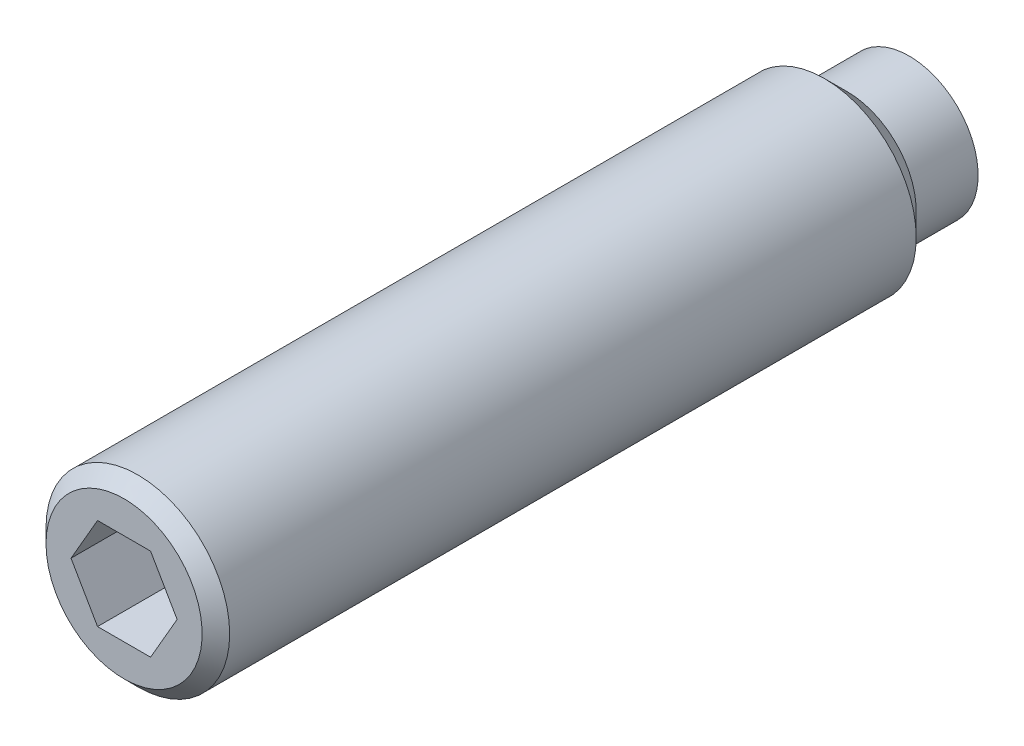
ISO-10303-21;
HEADER;
FILE_DESCRIPTION(('STEP AP214'),'2;1');
FILE_NAME('part.step','',(''),(''),'','','');
FILE_SCHEMA(('AUTOMOTIVE_DESIGN { 1 0 10303 214 1 1 1 1 }'));
ENDSEC;
DATA;
#1=APPLICATION_CONTEXT('core data for automotive mechanical design processes');
#2=APPLICATION_PROTOCOL_DEFINITION('international standard','automotive_design',2000,#1);
#3=PRODUCT_CONTEXT('',#1,'mechanical');
#4=PRODUCT('Part','Part','',(#3));
#5=PRODUCT_RELATED_PRODUCT_CATEGORY('part','',(#4));
#6=PRODUCT_DEFINITION_FORMATION('','',#4);
#7=PRODUCT_DEFINITION_CONTEXT('part definition',#1,'design');
#8=PRODUCT_DEFINITION('design','',#6,#7);
#9=PRODUCT_DEFINITION_SHAPE('','',#8);
#10=(LENGTH_UNIT() NAMED_UNIT(*) SI_UNIT(.MILLI.,.METRE.));
#11=(NAMED_UNIT(*) PLANE_ANGLE_UNIT() SI_UNIT($,.RADIAN.));
#12=(NAMED_UNIT(*) SI_UNIT($,.STERADIAN.) SOLID_ANGLE_UNIT());
#13=UNCERTAINTY_MEASURE_WITH_UNIT(LENGTH_MEASURE(1.E-05),#10,'distance_accuracy_value','');
#14=(GEOMETRIC_REPRESENTATION_CONTEXT(3) GLOBAL_UNCERTAINTY_ASSIGNED_CONTEXT((#13)) GLOBAL_UNIT_ASSIGNED_CONTEXT((#10,
#11,#12)) REPRESENTATION_CONTEXT('',''));
#15=CARTESIAN_POINT('',(0.,0.,0.));
#16=DIRECTION('',(0.,0.,1.));
#17=DIRECTION('',(1.,0.,0.));
#18=AXIS2_PLACEMENT_3D('',#15,#16,#17);
#19=CARTESIAN_POINT('',(0.,0.,-9.98399584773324));
#20=DIRECTION('',(0.,0.,1.));
#21=DIRECTION('',(1.,0.,0.));
#22=AXIS2_PLACEMENT_3D('',#19,#20,#21);
#23=CONICAL_SURFACE('',#22,4.64771999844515,1.04719754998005);
#24=CARTESIAN_POINT('',(4.62000000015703,1.07989878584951E-09,-9.9999999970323));
#25=CARTESIAN_POINT('',(4.51848948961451,0.17582136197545,-10.0586241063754));
#26=CARTESIAN_POINT('',(4.41610274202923,0.35316041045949,-10.1119396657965));
#27=CARTESIAN_POINT('',(4.20955648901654,0.710909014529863,-10.2050003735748));
#28=CARTESIAN_POINT('',(4.10539331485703,0.891324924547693,-10.2447126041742));
#29=CARTESIAN_POINT('',(3.89835780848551,1.24992094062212,-10.3065275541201));
#30=CARTESIAN_POINT('',(3.7955173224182,1.42804588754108,-10.3290417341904));
#31=CARTESIAN_POINT('',(3.58935270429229,1.78513348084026,-10.3559139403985));
#32=CARTESIAN_POINT('',(3.48602932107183,1.96409483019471,-10.3602942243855));
#33=CARTESIAN_POINT('',(3.29298066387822,2.2984649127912,-10.3511584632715));
#34=CARTESIAN_POINT('',(3.20322642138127,2.45392382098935,-10.3398855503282));
#35=CARTESIAN_POINT('',(3.02430265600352,2.7638288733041,-10.3041642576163));
#36=CARTESIAN_POINT('',(2.93513375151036,2.91827394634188,-10.2797036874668));
#37=CARTESIAN_POINT('',(2.75584138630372,3.22881743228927,-10.2185569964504));
#38=CARTESIAN_POINT('',(2.66574060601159,3.38487656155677,-10.1816117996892));
#39=CARTESIAN_POINT('',(2.48688250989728,3.69466787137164,-10.0977618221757));
#40=CARTESIAN_POINT('',(2.39812290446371,3.84840401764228,-10.050876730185));
#41=CARTESIAN_POINT('',(2.31000000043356,4.00103736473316,-9.99999999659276));
#42=B_SPLINE_CURVE_WITH_KNOTS('',3,(#24,#25,#26,#27,#28,#29,#30,#31,#32,#33,#34,#35,#36,#37,#38,
#39,#40,#41),.UNSPECIFIED.,.F.,.F.,(4,2,2,2,2,2,2,2,4),(0.,0.634196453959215,1.26991689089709,
1.88990521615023,2.509132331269,3.04820588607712,3.58777860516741,4.13931646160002,
4.68977188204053),.UNSPECIFIED.);
#43=CARTESIAN_POINT('',(4.61999999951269,0.,-9.9999999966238));
#44=VERTEX_POINT('',#43);
#45=CARTESIAN_POINT('',(2.30999999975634,4.00103736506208,-9.9999999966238));
#46=VERTEX_POINT('',#45);
#47=EDGE_CURVE('E144',#44,#46,#42,.T.);
#48=ORIENTED_EDGE('',*,*,#47,.T.);
#49=CARTESIAN_POINT('',(2.3099999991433,4.00103736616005,-9.9999999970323));
#50=CARTESIAN_POINT('',(2.1203719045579,4.0010373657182,-10.0547466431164));
#51=CARTESIAN_POINT('',(1.92924368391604,4.00103736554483,-10.1048687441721));
#52=CARTESIAN_POINT('',(1.54388249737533,4.00103736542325,-10.1934533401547));
#53=CARTESIAN_POINT('',(1.34964358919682,4.00103736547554,-10.2318897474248));
#54=CARTESIAN_POINT('',(0.963345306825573,4.00103736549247,-10.2937001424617));
#55=CARTESIAN_POINT('',(0.771340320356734,4.00103736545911,-10.3174036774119));
#56=CARTESIAN_POINT('',(0.386222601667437,4.00103736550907,-10.3492242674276));
#57=CARTESIAN_POINT('',(0.193111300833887,4.00103736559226,-10.3573582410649));
#58=CARTESIAN_POINT('',(-0.193111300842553,4.00103736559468,-10.3573582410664));
#59=CARTESIAN_POINT('',(-0.386222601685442,4.00103736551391,-10.3492242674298));
#60=CARTESIAN_POINT('',(-0.77134032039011,4.00103736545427,-10.3174036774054));
#61=CARTESIAN_POINT('',(-0.96334530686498,4.0010373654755,-10.2937001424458));
#62=CARTESIAN_POINT('',(-1.34964358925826,4.00103736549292,-10.2318897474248));
#63=CARTESIAN_POINT('',(-1.54388249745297,4.00103736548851,-10.1934533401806));
#64=CARTESIAN_POINT('',(-1.92924368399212,4.00103736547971,-10.1048687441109));
#65=CARTESIAN_POINT('',(-2.12037190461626,4.00103736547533,-10.0547466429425));
#66=CARTESIAN_POINT('',(-2.3099999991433,4.00103736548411,-9.99999999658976));
#67=B_SPLINE_CURVE_WITH_KNOTS('',3,(#49,#50,#51,#52,#53,#54,#55,#56,#57,#58,#59,#60,#61,#62,#63,
#64,#65,#66),.UNSPECIFIED.,.F.,.F.,(4,2,2,2,2,2,2,2,4),(0.,0.592300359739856,1.18591344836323,
1.76571952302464,2.34489519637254,2.92407086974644,3.50387694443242,4.09749003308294,
4.68979039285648),.UNSPECIFIED.);
#68=CARTESIAN_POINT('',(-2.30999999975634,4.00103736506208,-9.9999999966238));
#69=VERTEX_POINT('',#68);
#70=EDGE_CURVE('E165',#46,#69,#67,.T.);
#71=ORIENTED_EDGE('',*,*,#70,.T.);
#72=CARTESIAN_POINT('',(-2.31000000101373,4.00103736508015,-9.9999999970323));
#73=CARTESIAN_POINT('',(-2.41151051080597,3.82521600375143,-10.0586241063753));
#74=CARTESIAN_POINT('',(-2.51389725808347,3.64787695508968,-10.1119396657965));
#75=CARTESIAN_POINT('',(-2.72044351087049,3.29012835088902,-10.2050003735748));
#76=CARTESIAN_POINT('',(-2.82460668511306,3.10971244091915,-10.2447126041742));
#77=CARTESIAN_POINT('',(-3.03164219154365,2.75111642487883,-10.3065275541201));
#78=CARTESIAN_POINT('',(-3.13448267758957,2.57299147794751,-10.3290417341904));
#79=CARTESIAN_POINT('',(-3.34064729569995,2.21590388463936,-10.3559139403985));
#80=CARTESIAN_POINT('',(-3.44397067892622,2.03694253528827,-10.3602942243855));
#81=CARTESIAN_POINT('',(-3.63701933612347,1.70257245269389,-10.3511584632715));
#82=CARTESIAN_POINT('',(-3.72677357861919,1.54711354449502,-10.3398855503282));
#83=CARTESIAN_POINT('',(-3.90569734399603,1.23720849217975,-10.3041642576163));
#84=CARTESIAN_POINT('',(-3.99486624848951,1.08276341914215,-10.2797036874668));
#85=CARTESIAN_POINT('',(-4.17415861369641,0.772219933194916,-10.2185569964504));
#86=CARTESIAN_POINT('',(-4.26425939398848,0.61616080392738,-10.1816117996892));
#87=CARTESIAN_POINT('',(-4.44311749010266,0.306369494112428,-10.0977618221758));
#88=CARTESIAN_POINT('',(-4.53187709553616,0.152633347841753,-10.050876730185));
#89=CARTESIAN_POINT('',(-4.61999999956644,7.50947213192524E-10,-9.99999999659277));
#90=B_SPLINE_CURVE_WITH_KNOTS('',3,(#72,#73,#74,#75,#76,#77,#78,#79,#80,#81,#82,#83,#84,#85,#86,
#87,#88,#89),.UNSPECIFIED.,.F.,.F.,(4,2,2,2,2,2,2,2,4),(0.,0.634196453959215,1.26991689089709,
1.88990521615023,2.509132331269,3.04820588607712,3.58777860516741,4.13931646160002,
4.68977188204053),.UNSPECIFIED.);
#91=CARTESIAN_POINT('',(-4.61999999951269,0.,-9.9999999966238));
#92=VERTEX_POINT('',#91);
#93=EDGE_CURVE('E172',#69,#92,#90,.T.);
#94=ORIENTED_EDGE('',*,*,#93,.T.);
#95=CARTESIAN_POINT('',(-4.62000000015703,-1.07989712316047E-09,-9.9999999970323));
#96=CARTESIAN_POINT('',(-4.51848948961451,-0.175821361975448,-10.0586241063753));
#97=CARTESIAN_POINT('',(-4.41610274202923,-0.353160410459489,-10.1119396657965));
#98=CARTESIAN_POINT('',(-4.20955648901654,-0.710909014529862,-10.2050003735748));
#99=CARTESIAN_POINT('',(-4.10539331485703,-0.891324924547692,-10.2447126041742));
#100=CARTESIAN_POINT('',(-3.89835780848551,-1.24992094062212,-10.3065275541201));
#101=CARTESIAN_POINT('',(-3.7955173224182,-1.42804588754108,-10.3290417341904));
#102=CARTESIAN_POINT('',(-3.58935270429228,-1.78513348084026,-10.3559139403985));
#103=CARTESIAN_POINT('',(-3.48602932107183,-1.96409483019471,-10.3602942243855));
#104=CARTESIAN_POINT('',(-3.29298066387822,-2.2984649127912,-10.3511584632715));
#105=CARTESIAN_POINT('',(-3.20322642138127,-2.45392382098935,-10.3398855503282));
#106=CARTESIAN_POINT('',(-3.02430265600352,-2.76382887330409,-10.3041642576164));
#107=CARTESIAN_POINT('',(-2.93513375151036,-2.91827394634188,-10.2797036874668));
#108=CARTESIAN_POINT('',(-2.75584138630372,-3.22881743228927,-10.2185569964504));
#109=CARTESIAN_POINT('',(-2.66574060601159,-3.38487656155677,-10.1816117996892));
#110=CARTESIAN_POINT('',(-2.48688250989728,-3.69466787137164,-10.0977618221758));
#111=CARTESIAN_POINT('',(-2.39812290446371,-3.84840401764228,-10.050876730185));
#112=CARTESIAN_POINT('',(-2.31000000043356,-4.00103736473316,-9.99999999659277));
#113=B_SPLINE_CURVE_WITH_KNOTS('',3,(#95,#96,#97,#98,#99,#100,#101,#102,#103,#104,#105,#106,
#107,#108,#109,#110,#111,#112),.UNSPECIFIED.,.F.,.F.,(4,2,2,2,2,2,2,2,4),(0.,0.634196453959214,
1.26991689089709,1.88990521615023,2.509132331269,3.04820588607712,3.58777860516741,
4.13931646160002,4.68977188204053),.UNSPECIFIED.);
#114=CARTESIAN_POINT('',(-2.30999999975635,-4.00103736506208,-9.9999999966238));
#115=VERTEX_POINT('',#114);
#116=EDGE_CURVE('E177',#92,#115,#113,.T.);
#117=ORIENTED_EDGE('',*,*,#116,.T.);
#118=CARTESIAN_POINT('',(-2.3099999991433,-4.00103736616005,-9.9999999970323));
#119=CARTESIAN_POINT('',(-2.1203719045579,-4.00103736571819,-10.0547466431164));
#120=CARTESIAN_POINT('',(-1.92924368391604,-4.00103736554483,-10.1048687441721));
#121=CARTESIAN_POINT('',(-1.54388249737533,-4.00103736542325,-10.1934533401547));
#122=CARTESIAN_POINT('',(-1.34964358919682,-4.00103736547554,-10.2318897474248));
#123=CARTESIAN_POINT('',(-0.963345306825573,-4.00103736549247,-10.2937001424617));
#124=CARTESIAN_POINT('',(-0.771340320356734,-4.00103736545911,-10.3174036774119));
#125=CARTESIAN_POINT('',(-0.386222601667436,-4.00103736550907,-10.3492242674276));
#126=CARTESIAN_POINT('',(-0.193111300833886,-4.00103736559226,-10.3573582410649));
#127=CARTESIAN_POINT('',(0.193111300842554,-4.00103736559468,-10.3573582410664));
#128=CARTESIAN_POINT('',(0.386222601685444,-4.00103736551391,-10.3492242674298));
#129=CARTESIAN_POINT('',(0.771340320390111,-4.00103736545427,-10.3174036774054));
#130=CARTESIAN_POINT('',(0.963345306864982,-4.0010373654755,-10.2937001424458));
#131=CARTESIAN_POINT('',(1.34964358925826,-4.00103736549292,-10.2318897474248));
#132=CARTESIAN_POINT('',(1.54388249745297,-4.00103736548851,-10.1934533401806));
#133=CARTESIAN_POINT('',(1.92924368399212,-4.00103736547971,-10.1048687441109));
#134=CARTESIAN_POINT('',(2.12037190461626,-4.00103736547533,-10.0547466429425));
#135=CARTESIAN_POINT('',(2.3099999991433,-4.00103736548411,-9.99999999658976));
#136=B_SPLINE_CURVE_WITH_KNOTS('',3,(#118,#119,#120,#121,#122,#123,#124,#125,#126,#127,#128,
#129,#130,#131,#132,#133,#134,#135),.UNSPECIFIED.,.F.,.F.,(4,2,2,2,2,2,2,2,4),(0.,
0.592300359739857,1.18591344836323,1.76571952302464,2.34489519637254,2.92407086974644,
3.50387694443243,4.09749003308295,4.68979039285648),.UNSPECIFIED.);
#137=CARTESIAN_POINT('',(2.30999999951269,-4.00103736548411,-9.99999999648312));
#138=VERTEX_POINT('',#137);
#139=EDGE_CURVE('E74',#115,#138,#136,.T.);
#140=ORIENTED_EDGE('',*,*,#139,.T.);
#141=CARTESIAN_POINT('',(2.31000000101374,-4.00103736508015,-9.9999999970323));
#142=CARTESIAN_POINT('',(2.41151051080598,-3.82521600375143,-10.0586241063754));
#143=CARTESIAN_POINT('',(2.51389725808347,-3.64787695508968,-10.1119396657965));
#144=CARTESIAN_POINT('',(2.72044351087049,-3.29012835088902,-10.2050003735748));
#145=CARTESIAN_POINT('',(2.82460668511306,-3.10971244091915,-10.2447126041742));
#146=CARTESIAN_POINT('',(3.03164219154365,-2.75111642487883,-10.3065275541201));
#147=CARTESIAN_POINT('',(3.13448267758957,-2.57299147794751,-10.3290417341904));
#148=CARTESIAN_POINT('',(3.34064729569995,-2.21590388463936,-10.3559139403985));
#149=CARTESIAN_POINT('',(3.44397067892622,-2.03694253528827,-10.3602942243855));
#150=CARTESIAN_POINT('',(3.63701933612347,-1.70257245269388,-10.3511584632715));
#151=CARTESIAN_POINT('',(3.72677357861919,-1.54711354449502,-10.3398855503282));
#152=CARTESIAN_POINT('',(3.90569734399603,-1.23720849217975,-10.3041642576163));
#153=CARTESIAN_POINT('',(3.99486624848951,-1.08276341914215,-10.2797036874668));
#154=CARTESIAN_POINT('',(4.17415861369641,-0.772219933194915,-10.2185569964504));
#155=CARTESIAN_POINT('',(4.26425939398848,-0.616160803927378,-10.1816117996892));
#156=CARTESIAN_POINT('',(4.44311749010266,-0.306369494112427,-10.0977618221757));
#157=CARTESIAN_POINT('',(4.53187709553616,-0.152633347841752,-10.050876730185));
#158=CARTESIAN_POINT('',(4.61999999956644,-7.50945622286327E-10,-9.99999999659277));
#159=B_SPLINE_CURVE_WITH_KNOTS('',3,(#141,#142,#143,#144,#145,#146,#147,#148,#149,#150,#151,
#152,#153,#154,#155,#156,#157,#158),.UNSPECIFIED.,.F.,.F.,(4,2,2,2,2,2,2,2,4),(0.,
0.634196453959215,1.26991689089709,1.88990521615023,2.509132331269,3.04820588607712,
3.58777860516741,4.13931646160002,4.68977188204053),.UNSPECIFIED.);
#160=EDGE_CURVE('E106',#138,#44,#159,.T.);
#161=ORIENTED_EDGE('',*,*,#160,.T.);
#162=EDGE_LOOP('',(#48,#71,#94,#117,#140,#161));
#163=FACE_BOUND('',#162,.T.);
#164=CARTESIAN_POINT('',(0.,0.,-12.6673582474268));
#165=VERTEX_POINT('',#164);
#166=VERTEX_LOOP('',#165);
#167=FACE_BOUND('',#166,.T.);
#168=ADVANCED_FACE('F16',(#163,#167),#23,.F.);
#169=CARTESIAN_POINT('',(-2.31,-4.00103736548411,0.));
#170=DIRECTION('',(0.,-1.,0.));
#171=DIRECTION('',(0.,0.,-1.));
#172=AXIS2_PLACEMENT_3D('',#169,#170,#171);
#173=PLANE('',#172);
#174=ORIENTED_EDGE('',*,*,#139,.F.);
#175=DIRECTION('',(0.,0.,1.));
#176=VECTOR('',#175,1.);
#177=CARTESIAN_POINT('',(-2.31,-4.0010373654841,0.));
#178=LINE('',#177,#176);
#179=CARTESIAN_POINT('',(-2.31,-4.00103736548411,0.));
#180=VERTEX_POINT('',#179);
#181=EDGE_CURVE('E95',#115,#180,#178,.T.);
#182=ORIENTED_EDGE('',*,*,#181,.T.);
#183=DIRECTION('',(1.,0.,0.));
#184=VECTOR('',#183,1.);
#185=CARTESIAN_POINT('',(0.,-4.00103736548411,0.));
#186=LINE('',#185,#184);
#187=CARTESIAN_POINT('',(2.31,-4.00103736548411,0.));
#188=VERTEX_POINT('',#187);
#189=EDGE_CURVE('E89',#188,#180,#186,.F.);
#190=ORIENTED_EDGE('',*,*,#189,.F.);
#191=DIRECTION('',(0.,0.,1.));
#192=VECTOR('',#191,1.);
#193=CARTESIAN_POINT('',(2.31,-4.00103736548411,0.));
#194=LINE('',#193,#192);
#195=EDGE_CURVE('E92',#188,#138,#194,.F.);
#196=ORIENTED_EDGE('',*,*,#195,.T.);
#197=EDGE_LOOP('',(#174,#182,#190,#196));
#198=FACE_BOUND('',#197,.T.);
#199=ADVANCED_FACE('F91',(#198),#173,.F.);
#200=CARTESIAN_POINT('',(-4.62,0.,0.));
#201=DIRECTION('',(-0.866025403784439,-0.5,0.));
#202=DIRECTION('',(0.5,-0.866025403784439,0.));
#203=AXIS2_PLACEMENT_3D('',#200,#201,#202);
#204=PLANE('',#203);
#205=DIRECTION('',(0.,0.,1.));
#206=VECTOR('',#205,1.);
#207=CARTESIAN_POINT('',(-4.62,0.,0.));
#208=LINE('',#207,#206);
#209=CARTESIAN_POINT('',(-4.62,0.,0.));
#210=VERTEX_POINT('',#209);
#211=EDGE_CURVE('E181',#92,#210,#208,.T.);
#212=ORIENTED_EDGE('',*,*,#211,.T.);
#213=DIRECTION('',(-0.5,0.866025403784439,0.));
#214=VECTOR('',#213,1.);
#215=CARTESIAN_POINT('',(-2.31,-4.00103736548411,0.));
#216=LINE('',#215,#214);
#217=EDGE_CURVE('E100',#180,#210,#216,.T.);
#218=ORIENTED_EDGE('',*,*,#217,.F.);
#219=ORIENTED_EDGE('',*,*,#181,.F.);
#220=ORIENTED_EDGE('',*,*,#116,.F.);
#221=EDGE_LOOP('',(#212,#218,#219,#220));
#222=FACE_BOUND('',#221,.T.);
#223=ADVANCED_FACE('F182',(#222),#204,.F.);
#224=CARTESIAN_POINT('',(-2.31,4.00103736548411,0.));
#225=DIRECTION('',(-0.866025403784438,0.5,0.));
#226=DIRECTION('',(-0.5,-0.866025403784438,0.));
#227=AXIS2_PLACEMENT_3D('',#224,#225,#226);
#228=PLANE('',#227);
#229=DIRECTION('',(0.,0.,1.));
#230=VECTOR('',#229,1.);
#231=CARTESIAN_POINT('',(-2.31,4.00103736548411,0.));
#232=LINE('',#231,#230);
#233=CARTESIAN_POINT('',(-2.31,4.00103736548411,0.));
#234=VERTEX_POINT('',#233);
#235=EDGE_CURVE('E248',#69,#234,#232,.T.);
#236=ORIENTED_EDGE('',*,*,#235,.T.);
#237=DIRECTION('',(0.5,0.866025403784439,0.));
#238=VECTOR('',#237,1.);
#239=CARTESIAN_POINT('',(-4.62,0.,0.));
#240=LINE('',#239,#238);
#241=EDGE_CURVE('E125',#210,#234,#240,.T.);
#242=ORIENTED_EDGE('',*,*,#241,.F.);
#243=ORIENTED_EDGE('',*,*,#211,.F.);
#244=ORIENTED_EDGE('',*,*,#93,.F.);
#245=EDGE_LOOP('',(#236,#242,#243,#244));
#246=FACE_BOUND('',#245,.T.);
#247=ADVANCED_FACE('F185',(#246),#228,.F.);
#248=CARTESIAN_POINT('',(2.31,4.00103736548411,0.));
#249=DIRECTION('',(0.,1.,0.));
#250=DIRECTION('',(0.,0.,1.));
#251=AXIS2_PLACEMENT_3D('',#248,#249,#250);
#252=PLANE('',#251);
#253=ORIENTED_EDGE('',*,*,#70,.F.);
#254=DIRECTION('',(0.,0.,1.));
#255=VECTOR('',#254,1.);
#256=CARTESIAN_POINT('',(2.31,4.00103736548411,0.));
#257=LINE('',#256,#255);
#258=CARTESIAN_POINT('',(2.31,4.00103736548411,0.));
#259=VERTEX_POINT('',#258);
#260=EDGE_CURVE('E244',#46,#259,#257,.T.);
#261=ORIENTED_EDGE('',*,*,#260,.T.);
#262=DIRECTION('',(1.,0.,0.));
#263=VECTOR('',#262,1.);
#264=CARTESIAN_POINT('',(0.,4.00103736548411,0.));
#265=LINE('',#264,#263);
#266=EDGE_CURVE('E115',#234,#259,#265,.T.);
#267=ORIENTED_EDGE('',*,*,#266,.F.);
#268=ORIENTED_EDGE('',*,*,#235,.F.);
#269=EDGE_LOOP('',(#253,#261,#267,#268));
#270=FACE_BOUND('',#269,.T.);
#271=ADVANCED_FACE('F189',(#270),#252,.F.);
#272=CARTESIAN_POINT('',(4.62,0.,0.));
#273=DIRECTION('',(0.866025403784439,0.5,0.));
#274=DIRECTION('',(-0.5,0.866025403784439,0.));
#275=AXIS2_PLACEMENT_3D('',#272,#273,#274);
#276=PLANE('',#275);
#277=DIRECTION('',(0.,0.,1.));
#278=VECTOR('',#277,1.);
#279=CARTESIAN_POINT('',(4.62,0.,0.));
#280=LINE('',#279,#278);
#281=CARTESIAN_POINT('',(4.62,0.,0.));
#282=VERTEX_POINT('',#281);
#283=EDGE_CURVE('E37',#44,#282,#280,.T.);
#284=ORIENTED_EDGE('',*,*,#283,.T.);
#285=DIRECTION('',(0.5,-0.866025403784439,0.));
#286=VECTOR('',#285,1.);
#287=CARTESIAN_POINT('',(2.31,4.00103736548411,0.));
#288=LINE('',#287,#286);
#289=EDGE_CURVE('E111',#259,#282,#288,.T.);
#290=ORIENTED_EDGE('',*,*,#289,.F.);
#291=ORIENTED_EDGE('',*,*,#260,.F.);
#292=ORIENTED_EDGE('',*,*,#47,.F.);
#293=EDGE_LOOP('',(#284,#290,#291,#292));
#294=FACE_BOUND('',#293,.T.);
#295=ADVANCED_FACE('F193',(#294),#276,.F.);
#296=CARTESIAN_POINT('',(2.31,-4.00103736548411,0.));
#297=DIRECTION('',(0.866025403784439,-0.5,0.));
#298=DIRECTION('',(0.5,0.866025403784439,0.));
#299=AXIS2_PLACEMENT_3D('',#296,#297,#298);
#300=PLANE('',#299);
#301=ORIENTED_EDGE('',*,*,#195,.F.);
#302=DIRECTION('',(-0.5,-0.866025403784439,0.));
#303=VECTOR('',#302,1.);
#304=CARTESIAN_POINT('',(4.62,0.,0.));
#305=LINE('',#304,#303);
#306=EDGE_CURVE('E104',#282,#188,#305,.T.);
#307=ORIENTED_EDGE('',*,*,#306,.F.);
#308=ORIENTED_EDGE('',*,*,#283,.F.);
#309=ORIENTED_EDGE('',*,*,#160,.F.);
#310=EDGE_LOOP('',(#301,#307,#308,#309));
#311=FACE_BOUND('',#310,.T.);
#312=ADVANCED_FACE('F103',(#311),#300,.F.);
#313=CARTESIAN_POINT('',(0.,0.,-58.));
#314=DIRECTION('',(0.,0.,-1.));
#315=DIRECTION('',(0.,1.,0.));
#316=AXIS2_PLACEMENT_3D('',#313,#314,#315);
#317=SPHERICAL_SURFACE('',#316,12.);
#318=CARTESIAN_POINT('',(0.,0.,-70.));
#319=CARTESIAN_POINT('',(-0.130899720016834,-1.12259053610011E-13,-70.0000008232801));
#320=CARTESIAN_POINT('',(-0.261799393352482,-2.25987594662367E-13,-69.9978581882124));
#321=CARTESIAN_POINT('',(-0.52345859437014,-4.53322915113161E-13,-69.9892919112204));
#322=CARTESIAN_POINT('',(-0.654218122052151,-5.66929694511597E-13,-69.9828682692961));
#323=CARTESIAN_POINT('',(-0.915456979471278,-7.93899811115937E-13,-69.9657458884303));
#324=CARTESIAN_POINT('',(-1.04593630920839,-9.07263148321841E-13,-69.9550471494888));
#325=CARTESIAN_POINT('',(-1.30647505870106,-1.13362499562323E-12,-69.9293862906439));
#326=CARTESIAN_POINT('',(-1.4365344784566,-1.24662350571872E-12,-69.9144241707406));
#327=CARTESIAN_POINT('',(-1.69609413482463,-1.4721346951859E-12,-69.8802525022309));
#328=CARTESIAN_POINT('',(-1.82559437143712,-1.58464737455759E-12,-69.8610429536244));
#329=CARTESIAN_POINT('',(-2.08389699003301,-1.8090664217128E-12,-69.8183970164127));
#330=CARTESIAN_POINT('',(-2.21269937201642,-1.92097278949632E-12,-69.7949606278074));
#331=CARTESIAN_POINT('',(-2.46946835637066,-2.14405938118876E-12,-69.7438861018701));
#332=CARTESIAN_POINT('',(-2.59743495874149,-2.25523960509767E-12,-69.7162479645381));
#333=CARTESIAN_POINT('',(-2.85239535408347,-2.47675485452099E-12,-69.6567995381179));
#334=CARTESIAN_POINT('',(-2.97938914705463,-2.58708988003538E-12,-69.6249892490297));
#335=CARTESIAN_POINT('',(-3.23226793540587,-2.80679658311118E-12,-69.557230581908));
#336=CARTESIAN_POINT('',(-3.35815293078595,-2.91616826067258E-12,-69.5212822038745));
#337=CARTESIAN_POINT('',(-3.60867932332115,-3.13383115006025E-12,-69.4452858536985));
#338=CARTESIAN_POINT('',(-3.73332072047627,-3.24212236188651E-12,-69.4052378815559));
#339=CARTESIAN_POINT('',(-3.98122644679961,-3.45750835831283E-12,-69.3210852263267));
#340=CARTESIAN_POINT('',(-4.10449077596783,-3.56460314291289E-12,-69.2769805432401));
#341=CARTESIAN_POINT('',(-4.34951037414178,-3.77748160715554E-12,-69.1847616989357));
#342=CARTESIAN_POINT('',(-4.4712656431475,-3.88326528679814E-12,-69.1366475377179));
#343=CARTESIAN_POINT('',(-4.71313673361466,-4.09340825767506E-12,-69.036461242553));
#344=CARTESIAN_POINT('',(-4.83325255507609,-4.19776754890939E-12,-68.984389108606));
#345=CARTESIAN_POINT('',(-5.0717161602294,-4.40495002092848E-12,-68.8763426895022));
#346=CARTESIAN_POINT('',(-5.19006394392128,-4.50777320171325E-12,-68.8203684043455));
#347=CARTESIAN_POINT('',(-5.42486462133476,-4.71177324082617E-12,-68.704577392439));
#348=CARTESIAN_POINT('',(-5.54131751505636,-4.81295009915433E-12,-68.6447606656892));
#349=CARTESIAN_POINT('',(-5.77220416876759,-5.01354954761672E-12,-68.5213496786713));
#350=CARTESIAN_POINT('',(-5.88663792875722,-5.11297213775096E-12,-68.4577554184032));
#351=CARTESIAN_POINT('',(-6.00000000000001,-5.21146362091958E-12,-68.3923048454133));
#352=B_SPLINE_CURVE_WITH_KNOTS('',3,(#318,#319,#320,#321,#322,#323,#324,#325,#326,#327,#328,
#329,#330,#331,#332,#333,#334,#335,#336,#337,#338,#339,#340,#341,#342,#343,#344,#345,#346,#347,
#348,#349,#350,#351),.UNSPECIFIED.,.F.,.F.,(4,2,2,2,2,2,2,2,2,2,2,2,2,2,2,2,4),(0.,
0.392681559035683,0.785363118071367,1.17804467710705,1.57072623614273,1.96340779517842,
2.3560893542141,2.74877091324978,3.14145247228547,3.53413403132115,3.92681559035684,
4.31949714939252,4.7121787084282,5.10486026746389,5.49754182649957,5.89022338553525,
6.28290494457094),.UNSPECIFIED.);
#353=CARTESIAN_POINT('',(0.,0.,-70.));
#354=VERTEX_POINT('',#353);
#355=CARTESIAN_POINT('',(-6.,-2.60564323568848E-12,-68.3923048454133));
#356=VERTEX_POINT('',#355);
#357=EDGE_CURVE('E82',#354,#356,#352,.T.);
#358=ORIENTED_EDGE('',*,*,#357,.T.);
#359=CARTESIAN_POINT('',(0.,0.,-68.3923048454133));
#360=DIRECTION('',(0.,0.,-1.));
#361=DIRECTION('',(-1.,0.,0.));
#362=AXIS2_PLACEMENT_3D('',#359,#360,#361);
#363=CIRCLE('',#362,6.);
#364=EDGE_CURVE('E85',#356,#356,#363,.F.);
#365=ORIENTED_EDGE('',*,*,#364,.F.);
#366=ORIENTED_EDGE('',*,*,#357,.F.);
#367=EDGE_LOOP('',(#358,#365,#366));
#368=FACE_BOUND('',#367,.T.);
#369=ADVANCED_FACE('F200',(#368),#317,.T.);
#370=CARTESIAN_POINT('',(0.,3.4,0.));
#371=DIRECTION('',(0.,0.,1.));
#372=DIRECTION('',(1.,0.,0.));
#373=AXIS2_PLACEMENT_3D('',#370,#371,#372);
#374=PLANE('',#373);
#375=ORIENTED_EDGE('',*,*,#289,.T.);
#376=ORIENTED_EDGE('',*,*,#306,.T.);
#377=ORIENTED_EDGE('',*,*,#189,.T.);
#378=ORIENTED_EDGE('',*,*,#217,.T.);
#379=ORIENTED_EDGE('',*,*,#241,.T.);
#380=ORIENTED_EDGE('',*,*,#266,.T.);
#381=EDGE_LOOP('',(#375,#376,#377,#378,#379,#380));
#382=FACE_BOUND('',#381,.T.);
#383=CARTESIAN_POINT('',(0.,0.,5.38469442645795E-10));
#384=DIRECTION('',(0.,0.,-1.));
#385=DIRECTION('',(-1.,0.,0.));
#386=AXIS2_PLACEMENT_3D('',#383,#384,#385);
#387=CIRCLE('',#386,6.80000000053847);
#388=CARTESIAN_POINT('',(-6.80000000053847,0.,5.38468889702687E-10));
#389=VERTEX_POINT('',#388);
#390=EDGE_CURVE('E113',#389,#389,#387,.T.);
#391=ORIENTED_EDGE('',*,*,#390,.F.);
#392=EDGE_LOOP('',(#391));
#393=FACE_BOUND('',#392,.T.);
#394=ADVANCED_FACE('F108',(#382,#393),#374,.T.);
#395=CARTESIAN_POINT('',(0.,0.,-65.6961524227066));
#396=DIRECTION('',(0.,0.,-1.));
#397=DIRECTION('',(-1.,0.,0.));
#398=AXIS2_PLACEMENT_3D('',#395,#396,#397);
#399=CYLINDRICAL_SURFACE('',#398,6.);
#400=CARTESIAN_POINT('',(0.,0.,-63.0000000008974));
#401=DIRECTION('',(0.,0.,1.));
#402=DIRECTION('',(0.,1.,0.));
#403=AXIS2_PLACEMENT_3D('',#400,#401,#402);
#404=CIRCLE('',#403,6.00000000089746);
#405=CARTESIAN_POINT('',(0.,6.00000000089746,-63.0000000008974));
#406=VERTEX_POINT('',#405);
#407=EDGE_CURVE('E137',#406,#406,#404,.T.);
#408=ORIENTED_EDGE('',*,*,#407,.F.);
#409=EDGE_LOOP('',(#408));
#410=FACE_BOUND('',#409,.T.);
#411=ORIENTED_EDGE('',*,*,#364,.T.);
#412=EDGE_LOOP('',(#411));
#413=FACE_BOUND('',#412,.T.);
#414=ADVANCED_FACE('F265',(#410,#413),#399,.T.);
#415=CARTESIAN_POINT('',(0.,0.,-1.20000000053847));
#416=DIRECTION('',(0.,0.,-1.));
#417=DIRECTION('',(-1.,0.,0.));
#418=AXIS2_PLACEMENT_3D('',#415,#416,#417);
#419=CONICAL_SURFACE('',#418,7.99999999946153,0.7853981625);
#420=ORIENTED_EDGE('',*,*,#390,.T.);
#421=EDGE_LOOP('',(#420));
#422=FACE_BOUND('',#421,.T.);
#423=CARTESIAN_POINT('',(0.,0.,-1.2));
#424=DIRECTION('',(0.,0.,-1.));
#425=DIRECTION('',(-1.,0.,0.));
#426=AXIS2_PLACEMENT_3D('',#423,#424,#425);
#427=CIRCLE('',#426,8.);
#428=CARTESIAN_POINT('',(-8.,0.,-1.2));
#429=VERTEX_POINT('',#428);
#430=EDGE_CURVE('E28',#429,#429,#427,.T.);
#431=ORIENTED_EDGE('',*,*,#430,.F.);
#432=EDGE_LOOP('',(#431));
#433=FACE_BOUND('',#432,.T.);
#434=ADVANCED_FACE('F206',(#422,#433),#419,.T.);
#435=CARTESIAN_POINT('',(0.,0.,-60.9999999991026));
#436=DIRECTION('',(0.,0.,1.));
#437=DIRECTION('',(1.,0.,0.));
#438=AXIS2_PLACEMENT_3D('',#435,#436,#437);
#439=CONICAL_SURFACE('',#438,7.99999999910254,0.785398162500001);
#440=CARTESIAN_POINT('',(0.,0.,-61.));
#441=DIRECTION('',(0.,0.,-1.));
#442=DIRECTION('',(-1.,0.,0.));
#443=AXIS2_PLACEMENT_3D('',#440,#441,#442);
#444=CIRCLE('',#443,8.);
#445=CARTESIAN_POINT('',(-7.99999999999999,0.,-61.));
#446=VERTEX_POINT('',#445);
#447=EDGE_CURVE('E10',#446,#446,#444,.F.);
#448=ORIENTED_EDGE('',*,*,#447,.F.);
#449=EDGE_LOOP('',(#448));
#450=FACE_BOUND('',#449,.T.);
#451=ORIENTED_EDGE('',*,*,#407,.T.);
#452=EDGE_LOOP('',(#451));
#453=FACE_BOUND('',#452,.T.);
#454=ADVANCED_FACE('F202',(#450,#453),#439,.T.);
#455=CARTESIAN_POINT('',(0.,0.,-31.1));
#456=DIRECTION('',(0.,0.,-1.));
#457=DIRECTION('',(-1.,0.,0.));
#458=AXIS2_PLACEMENT_3D('',#455,#456,#457);
#459=CYLINDRICAL_SURFACE('',#458,8.);
#460=ORIENTED_EDGE('',*,*,#430,.T.);
#461=EDGE_LOOP('',(#460));
#462=FACE_BOUND('',#461,.T.);
#463=ORIENTED_EDGE('',*,*,#447,.T.);
#464=EDGE_LOOP('',(#463));
#465=FACE_BOUND('',#464,.T.);
#466=ADVANCED_FACE('F18',(#462,#465),#459,.T.);
#467=CLOSED_SHELL('',(#168,#199,#223,#247,#271,#295,#312,#369,#394,#414,#434,#454,#466));
#468=MANIFOLD_SOLID_BREP('B1',#467);
#469=ADVANCED_BREP_SHAPE_REPRESENTATION('',(#18,#468),#14);
#470=SHAPE_DEFINITION_REPRESENTATION(#9,#469);
ENDSEC;
END-ISO-10303-21;
